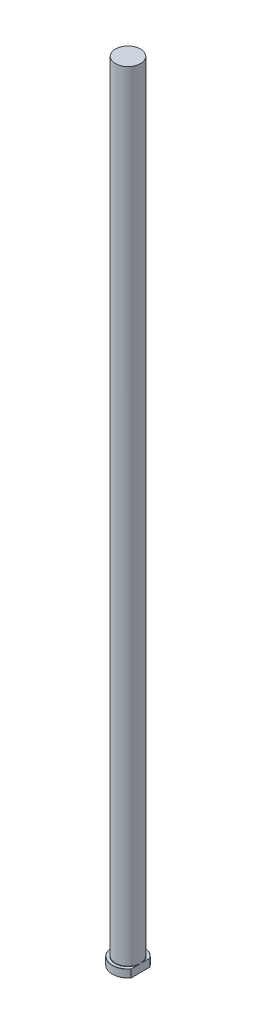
ISO-10303-21;
HEADER;
FILE_DESCRIPTION(('STEP AP214'),'2;1');
FILE_NAME('part.step','',(''),(''),'','','');
FILE_SCHEMA(('AUTOMOTIVE_DESIGN { 1 0 10303 214 1 1 1 1 }'));
ENDSEC;
DATA;
#1=APPLICATION_CONTEXT('core data for automotive mechanical design processes');
#2=APPLICATION_PROTOCOL_DEFINITION('international standard','automotive_design',2000,#1);
#3=PRODUCT_CONTEXT('',#1,'mechanical');
#4=PRODUCT('Part','Part','',(#3));
#5=PRODUCT_RELATED_PRODUCT_CATEGORY('part','',(#4));
#6=PRODUCT_DEFINITION_FORMATION('','',#4);
#7=PRODUCT_DEFINITION_CONTEXT('part definition',#1,'design');
#8=PRODUCT_DEFINITION('design','',#6,#7);
#9=PRODUCT_DEFINITION_SHAPE('','',#8);
#10=(LENGTH_UNIT() NAMED_UNIT(*) SI_UNIT(.MILLI.,.METRE.));
#11=(NAMED_UNIT(*) PLANE_ANGLE_UNIT() SI_UNIT($,.RADIAN.));
#12=(NAMED_UNIT(*) SI_UNIT($,.STERADIAN.) SOLID_ANGLE_UNIT());
#13=UNCERTAINTY_MEASURE_WITH_UNIT(LENGTH_MEASURE(1.E-05),#10,'distance_accuracy_value','');
#14=(GEOMETRIC_REPRESENTATION_CONTEXT(3) GLOBAL_UNCERTAINTY_ASSIGNED_CONTEXT((#13)) GLOBAL_UNIT_ASSIGNED_CONTEXT((#10,
#11,#12)) REPRESENTATION_CONTEXT('',''));
#15=CARTESIAN_POINT('',(0.,0.,0.));
#16=DIRECTION('',(0.,0.,1.));
#17=DIRECTION('',(1.,0.,0.));
#18=AXIS2_PLACEMENT_3D('',#15,#16,#17);
#19=CARTESIAN_POINT('',(0.,0.,0.));
#20=DIRECTION('',(0.,-1.,0.));
#21=DIRECTION('',(0.,0.,-1.));
#22=AXIS2_PLACEMENT_3D('',#19,#20,#21);
#23=PLANE('',#22);
#24=CARTESIAN_POINT('',(0.,0.,0.));
#25=DIRECTION('',(0.,-1.,0.));
#26=DIRECTION('',(0.,0.,-1.));
#27=AXIS2_PLACEMENT_3D('',#24,#25,#26);
#28=CIRCLE('',#27,19.7999999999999);
#29=CARTESIAN_POINT('',(16.,0.,11.6636186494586));
#30=VERTEX_POINT('',#29);
#31=CARTESIAN_POINT('',(16.,0.,-11.6636186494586));
#32=VERTEX_POINT('',#31);
#33=EDGE_CURVE('E98',#30,#32,#28,.T.);
#34=ORIENTED_EDGE('',*,*,#33,.T.);
#35=DIRECTION('',(0.,0.,1.));
#36=VECTOR('',#35,1.);
#37=CARTESIAN_POINT('',(16.,0.,-12.));
#38=LINE('',#37,#36);
#39=EDGE_CURVE('E83',#32,#30,#38,.T.);
#40=ORIENTED_EDGE('',*,*,#39,.T.);
#41=EDGE_LOOP('',(#34,#40));
#42=FACE_BOUND('',#41,.T.);
#43=ADVANCED_FACE('F32',(#42),#23,.T.);
#44=CARTESIAN_POINT('',(0.,259.958771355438,0.));
#45=DIRECTION('',(0.,1.,0.));
#46=DIRECTION('',(0.,0.,1.));
#47=AXIS2_PLACEMENT_3D('',#44,#45,#46);
#48=CYLINDRICAL_SURFACE('',#47,20.);
#49=CARTESIAN_POINT('',(0.,9.80000000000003,0.));
#50=DIRECTION('',(0.,1.,0.));
#51=DIRECTION('',(0.,0.,1.));
#52=AXIS2_PLACEMENT_3D('',#49,#50,#51);
#53=CIRCLE('',#52,20.);
#54=CARTESIAN_POINT('',(16.,9.80000000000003,12.));
#55=VERTEX_POINT('',#54);
#56=CARTESIAN_POINT('',(16.,9.80000000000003,-12.));
#57=VERTEX_POINT('',#56);
#58=EDGE_CURVE('E104',#55,#57,#53,.F.);
#59=ORIENTED_EDGE('',*,*,#58,.T.);
#60=DIRECTION('',(0.,-1.,0.));
#61=VECTOR('',#60,1.);
#62=CARTESIAN_POINT('',(16.,1000.,-12.));
#63=LINE('',#62,#61);
#64=CARTESIAN_POINT('',(16.,0.200000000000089,-12.));
#65=VERTEX_POINT('',#64);
#66=EDGE_CURVE('E183',#57,#65,#63,.T.);
#67=ORIENTED_EDGE('',*,*,#66,.T.);
#68=CARTESIAN_POINT('',(0.,0.200000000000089,0.));
#69=DIRECTION('',(0.,-1.,0.));
#70=DIRECTION('',(0.,0.,-1.));
#71=AXIS2_PLACEMENT_3D('',#68,#69,#70);
#72=CIRCLE('',#71,20.);
#73=CARTESIAN_POINT('',(16.,0.200000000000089,12.));
#74=VERTEX_POINT('',#73);
#75=EDGE_CURVE('E100',#65,#74,#72,.F.);
#76=ORIENTED_EDGE('',*,*,#75,.T.);
#77=DIRECTION('',(0.,-1.,0.));
#78=VECTOR('',#77,1.);
#79=CARTESIAN_POINT('',(16.,1000.,12.));
#80=LINE('',#79,#78);
#81=EDGE_CURVE('E93',#55,#74,#80,.T.);
#82=ORIENTED_EDGE('',*,*,#81,.F.);
#83=EDGE_LOOP('',(#59,#67,#76,#82));
#84=FACE_BOUND('',#83,.T.);
#85=ADVANCED_FACE('F158',(#84),#48,.T.);
#86=CARTESIAN_POINT('',(-20.,10.,0.));
#87=DIRECTION('',(0.,1.,0.));
#88=DIRECTION('',(0.,0.,1.));
#89=AXIS2_PLACEMENT_3D('',#86,#87,#88);
#90=PLANE('',#89);
#91=CARTESIAN_POINT('',(0.,10.,0.));
#92=DIRECTION('',(0.,1.,0.));
#93=DIRECTION('',(0.,0.,1.));
#94=AXIS2_PLACEMENT_3D('',#91,#92,#93);
#95=CIRCLE('',#94,19.7999999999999);
#96=CARTESIAN_POINT('',(16.,10.,-11.6636186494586));
#97=VERTEX_POINT('',#96);
#98=CARTESIAN_POINT('',(16.,10.,11.6636186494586));
#99=VERTEX_POINT('',#98);
#100=EDGE_CURVE('E178',#97,#99,#95,.T.);
#101=ORIENTED_EDGE('',*,*,#100,.T.);
#102=DIRECTION('',(0.,0.,-1.));
#103=VECTOR('',#102,1.);
#104=CARTESIAN_POINT('',(16.,10.,0.));
#105=LINE('',#104,#103);
#106=CARTESIAN_POINT('',(16.,10.,3.1128764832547));
#107=VERTEX_POINT('',#106);
#108=EDGE_CURVE('E57',#99,#107,#105,.T.);
#109=ORIENTED_EDGE('',*,*,#108,.T.);
#110=CARTESIAN_POINT('',(0.,10.,0.));
#111=DIRECTION('',(0.,1.,0.));
#112=DIRECTION('',(0.,0.,1.));
#113=AXIS2_PLACEMENT_3D('',#110,#111,#112);
#114=CIRCLE('',#113,16.3);
#115=CARTESIAN_POINT('',(16.,10.,-3.11287648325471));
#116=VERTEX_POINT('',#115);
#117=EDGE_CURVE('E107',#107,#116,#114,.F.);
#118=ORIENTED_EDGE('',*,*,#117,.T.);
#119=EDGE_CURVE('E136',#116,#97,#105,.T.);
#120=ORIENTED_EDGE('',*,*,#119,.T.);
#121=EDGE_LOOP('',(#101,#109,#118,#120));
#122=FACE_BOUND('',#121,.T.);
#123=ADVANCED_FACE('F147',(#122),#90,.T.);
#124=CARTESIAN_POINT('',(0.,10.,0.));
#125=DIRECTION('',(0.,-1.,0.));
#126=DIRECTION('',(0.,0.,-1.));
#127=AXIS2_PLACEMENT_3D('',#124,#125,#126);
#128=CONICAL_SURFACE('',#127,19.7999999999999,0.785398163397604);
#129=ORIENTED_EDGE('',*,*,#58,.F.);
#130=CARTESIAN_POINT('',(16.,-1.07064884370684,26.4006999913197));
#131=CARTESIAN_POINT('',(16.,-0.733156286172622,26.0060486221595));
#132=CARTESIAN_POINT('',(16.,-0.396819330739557,25.6104050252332));
#133=CARTESIAN_POINT('',(16.,0.27320617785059,24.8168690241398));
#134=CARTESIAN_POINT('',(16.,0.606894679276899,24.4189765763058));
#135=CARTESIAN_POINT('',(16.,1.27144329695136,23.6204891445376));
#136=CARTESIAN_POINT('',(16.,1.60230187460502,23.2198928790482));
#137=CARTESIAN_POINT('',(16.,2.26059114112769,22.4158945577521));
#138=CARTESIAN_POINT('',(16.,2.58802184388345,22.0124925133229));
#139=CARTESIAN_POINT('',(16.,3.24766747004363,21.1916872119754));
#140=CARTESIAN_POINT('',(16.,3.57977582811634,20.7741982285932));
#141=CARTESIAN_POINT('',(16.,4.23919239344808,19.9354474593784));
#142=CARTESIAN_POINT('',(16.,4.566500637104,19.5141857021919));
#143=CARTESIAN_POINT('',(16.,5.21544461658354,18.6674666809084));
#144=CARTESIAN_POINT('',(16.,5.53708166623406,18.2420104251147));
#145=CARTESIAN_POINT('',(16.,6.17378218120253,17.386199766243));
#146=CARTESIAN_POINT('',(16.,6.48884565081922,16.9558453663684));
#147=CARTESIAN_POINT('',(16.,7.11176935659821,16.08872181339));
#148=CARTESIAN_POINT('',(16.,7.41961501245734,15.651942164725));
#149=CARTESIAN_POINT('',(16.,8.02597466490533,14.7719292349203));
#150=CARTESIAN_POINT('',(16.,8.32448855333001,14.3286958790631));
#151=CARTESIAN_POINT('',(16.,8.91052998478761,13.4344389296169));
#152=CARTESIAN_POINT('',(16.,9.19804754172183,12.983408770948));
#153=CARTESIAN_POINT('',(16.,9.75938980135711,12.0728858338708));
#154=CARTESIAN_POINT('',(16.,10.0332147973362,11.6133932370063));
#155=CARTESIAN_POINT('',(16.,10.561533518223,10.6892898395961));
#156=CARTESIAN_POINT('',(16.,10.8161891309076,10.2247720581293));
#157=CARTESIAN_POINT('',(16.,11.3053445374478,9.28510847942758));
#158=CARTESIAN_POINT('',(16.,11.539841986,8.809961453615));
#159=CARTESIAN_POINT('',(16.,11.9836278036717,7.84885100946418));
#160=CARTESIAN_POINT('',(16.,12.1929556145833,7.36290596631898));
#161=CARTESIAN_POINT('',(16.,12.5811435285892,6.37912337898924));
#162=CARTESIAN_POINT('',(16.,12.7600157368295,5.88129064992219));
#163=CARTESIAN_POINT('',(16.,13.0861366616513,4.85753764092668));
#164=CARTESIAN_POINT('',(16.,13.2321910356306,4.3312282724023));
#165=CARTESIAN_POINT('',(16.,13.4164504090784,3.53379728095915));
#166=CARTESIAN_POINT('',(16.,13.4720698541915,3.26663533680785));
#167=CARTESIAN_POINT('',(16.,13.5709016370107,2.73003918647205));
#168=CARTESIAN_POINT('',(16.,13.6141156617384,2.460605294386));
#169=CARTESIAN_POINT('',(16.,13.6872774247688,1.92117630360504));
#170=CARTESIAN_POINT('',(16.,13.7172841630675,1.65118922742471));
#171=CARTESIAN_POINT('',(16.,13.7638048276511,1.11005042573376));
#172=CARTESIAN_POINT('',(16.,13.7803188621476,0.83889870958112));
#173=CARTESIAN_POINT('',(16.,13.7995586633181,0.296109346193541));
#174=CARTESIAN_POINT('',(16.,13.8022847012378,0.0244717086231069));
#175=CARTESIAN_POINT('',(16.,13.7939006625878,-0.518588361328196));
#176=CARTESIAN_POINT('',(16.,13.7827905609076,-0.790010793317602));
#177=CARTESIAN_POINT('',(16.,13.7469663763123,-1.33142514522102));
#178=CARTESIAN_POINT('',(16.,13.7222788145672,-1.60141882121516));
#179=CARTESIAN_POINT('',(16.,13.6597540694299,-2.13989179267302));
#180=CARTESIAN_POINT('',(16.,13.6219151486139,-2.40837088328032));
#181=CARTESIAN_POINT('',(16.,13.4895557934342,-3.21066813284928));
#182=CARTESIAN_POINT('',(16.,13.3761851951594,-3.74145456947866));
#183=CARTESIAN_POINT('',(16.,13.1048507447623,-4.79469191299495));
#184=CARTESIAN_POINT('',(16.,12.9466209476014,-5.31707285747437));
#185=CARTESIAN_POINT('',(16.,12.6815624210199,-6.09095035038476));
#186=CARTESIAN_POINT('',(16.,12.5885858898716,-6.34730496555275));
#187=CARTESIAN_POINT('',(16.,12.3942381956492,-6.85681818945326));
#188=CARTESIAN_POINT('',(16.,12.2928668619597,-7.10997673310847));
#189=CARTESIAN_POINT('',(16.,11.9087737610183,-8.02895093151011));
#190=CARTESIAN_POINT('',(16.,11.6032209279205,-8.68528507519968));
#191=CARTESIAN_POINT('',(16.,10.9520387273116,-9.97785473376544));
#192=CARTESIAN_POINT('',(16.,10.606384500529,-10.6140774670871));
#193=CARTESIAN_POINT('',(16.,9.88410853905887,-11.8704402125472));
#194=CARTESIAN_POINT('',(16.,9.50742027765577,-12.490541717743));
#195=CARTESIAN_POINT('',(16.,8.73104614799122,-13.7158784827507));
#196=CARTESIAN_POINT('',(16.,8.33136526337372,-14.3211169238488));
#197=CARTESIAN_POINT('',(16.,7.51225576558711,-15.522152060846));
#198=CARTESIAN_POINT('',(16.,7.09274396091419,-16.1178917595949));
#199=CARTESIAN_POINT('',(16.,6.23957009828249,-17.2991512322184));
#200=CARTESIAN_POINT('',(16.,5.80590743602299,-17.8846705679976));
#201=CARTESIAN_POINT('',(16.,4.92783508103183,-19.0464967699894));
#202=CARTESIAN_POINT('',(16.,4.48343853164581,-19.622813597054));
#203=CARTESIAN_POINT('',(16.,3.58557777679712,-20.7683027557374));
#204=CARTESIAN_POINT('',(16.,3.13211380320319,-21.3374752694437));
#205=CARTESIAN_POINT('',(16.,2.36744022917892,-22.2844266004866));
#206=CARTESIAN_POINT('',(16.,2.05826684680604,-22.66385398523));
#207=CARTESIAN_POINT('',(16.,1.43690833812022,-23.4203229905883));
#208=CARTESIAN_POINT('',(16.,1.12472279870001,-23.7973642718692));
#209=CARTESIAN_POINT('',(16.,0.49995656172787,-24.5465888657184));
#210=CARTESIAN_POINT('',(16.,0.18739441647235,-24.9187876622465));
#211=CARTESIAN_POINT('',(16.,-0.439990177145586,-25.6611808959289));
#212=CARTESIAN_POINT('',(16.,-0.754812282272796,-26.0313756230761));
#213=CARTESIAN_POINT('',(16.,-1.07064884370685,-26.4006999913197));
#214=B_SPLINE_CURVE_WITH_KNOTS('',3,(#130,#131,#132,#133,#134,#135,#136,#137,#138,#139,#140,
#141,#142,#143,#144,#145,#146,#147,#148,#149,#150,#151,#152,#153,#154,#155,#156,#157,#158,#159,
#160,#161,#162,#163,#164,#165,#166,#167,#168,#169,#170,#171,#172,#173,#174,#175,#176,#177,#178,
#179,#180,#181,#182,#183,#184,#185,#186,#187,#188,#189,#190,#191,#192,#193,#194,#195,#196,#197,
#198,#199,#200,#201,#202,#203,#204,#205,#206,#207,#208,#209,#210,#211,#212,#213),.UNSPECIFIED.,
.F.,.F.,(4,2,2,2,2,2,2,2,2,2,2,2,2,2,2,2,2,2,2,2,2,2,2,2,2,2,2,2,2,2,2,2,2,2,2,2,2,2,2,2,2,4),
(0.,1.55783999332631,3.11571034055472,4.67437978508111,6.23304291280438,7.83343038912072,
9.43380572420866,11.0338053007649,12.6338038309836,14.236795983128,15.8398067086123,
17.4442401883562,19.048639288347,20.6374598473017,22.226465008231,23.8129467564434,
25.3987964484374,27.0353648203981,27.8537926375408,28.6721091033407,29.4867319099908,
30.3013481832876,31.1159484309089,31.9305501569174,32.7435663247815,33.5566899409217,
35.1826128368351,36.8183840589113,37.6363419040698,38.4543163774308,40.6241539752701,
42.7953439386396,44.9713157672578,47.1468177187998,49.3324366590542,51.5181490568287,
53.7013086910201,55.8844125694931,57.3527237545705,58.82123925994,60.2793254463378,
61.7371946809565),.UNSPECIFIED.);
#215=EDGE_CURVE('E135',#55,#99,#214,.T.);
#216=ORIENTED_EDGE('',*,*,#215,.T.);
#217=ORIENTED_EDGE('',*,*,#100,.F.);
#218=EDGE_CURVE('E127',#97,#57,#214,.T.);
#219=ORIENTED_EDGE('',*,*,#218,.T.);
#220=EDGE_LOOP('',(#129,#216,#217,#219));
#221=FACE_BOUND('',#220,.T.);
#222=ADVANCED_FACE('F143',(#221),#128,.T.);
#223=CARTESIAN_POINT('',(0.,0.200000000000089,0.));
#224=DIRECTION('',(0.,1.,0.));
#225=DIRECTION('',(0.,0.,1.));
#226=AXIS2_PLACEMENT_3D('',#223,#224,#225);
#227=CONICAL_SURFACE('',#226,20.,0.785398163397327);
#228=ORIENTED_EDGE('',*,*,#75,.F.);
#229=CARTESIAN_POINT('',(16.,11.070648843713,-26.4006999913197));
#230=CARTESIAN_POINT('',(16.,10.7331562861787,-26.0060486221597));
#231=CARTESIAN_POINT('',(16.,10.3968193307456,-25.6104050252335));
#232=CARTESIAN_POINT('',(16.,9.72679382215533,-24.8168690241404));
#233=CARTESIAN_POINT('',(16.,9.39310532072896,-24.4189765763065));
#234=CARTESIAN_POINT('',(16.,8.72855670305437,-23.6204891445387));
#235=CARTESIAN_POINT('',(16.,8.39769812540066,-23.2198928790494));
#236=CARTESIAN_POINT('',(16.,7.73940885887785,-22.4158945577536));
#237=CARTESIAN_POINT('',(16.,7.41197815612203,-22.0124925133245));
#238=CARTESIAN_POINT('',(16.,6.75233252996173,-21.1916872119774));
#239=CARTESIAN_POINT('',(16.,6.42022417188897,-20.7741982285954));
#240=CARTESIAN_POINT('',(16.,5.76080760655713,-19.935447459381));
#241=CARTESIAN_POINT('',(16.,5.43349936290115,-19.5141857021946));
#242=CARTESIAN_POINT('',(16.,4.7845553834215,-18.6674666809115));
#243=CARTESIAN_POINT('',(16.,4.46291833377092,-18.242010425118));
#244=CARTESIAN_POINT('',(16.,3.82621781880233,-17.3861997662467));
#245=CARTESIAN_POINT('',(16.,3.51115434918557,-16.9558453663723));
#246=CARTESIAN_POINT('',(16.,2.88823064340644,-16.0887218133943));
#247=CARTESIAN_POINT('',(16.,2.58038498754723,-15.6519421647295));
#248=CARTESIAN_POINT('',(16.,1.97402533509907,-14.7719292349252));
#249=CARTESIAN_POINT('',(16.,1.67551144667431,-14.3286958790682));
#250=CARTESIAN_POINT('',(16.,1.08947001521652,-13.4344389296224));
#251=CARTESIAN_POINT('',(16.,0.801952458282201,-12.9834087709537));
#252=CARTESIAN_POINT('',(16.,0.240610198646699,-12.0728858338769));
#253=CARTESIAN_POINT('',(16.,-0.0332147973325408,-11.6133932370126));
#254=CARTESIAN_POINT('',(16.,-0.561533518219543,-10.6892898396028));
#255=CARTESIAN_POINT('',(16.,-0.816189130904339,-10.2247720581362));
#256=CARTESIAN_POINT('',(16.,-1.30534453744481,-9.28510847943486));
#257=CARTESIAN_POINT('',(16.,-1.53984198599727,-8.80996145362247));
#258=CARTESIAN_POINT('',(16.,-1.98362780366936,-7.84885100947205));
#259=CARTESIAN_POINT('',(16.,-2.19295561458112,-7.36290596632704));
#260=CARTESIAN_POINT('',(16.,-2.58114352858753,-6.37912337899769));
#261=CARTESIAN_POINT('',(16.,-2.76001573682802,-5.88129064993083));
#262=CARTESIAN_POINT('',(16.,-3.08613666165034,-4.85753764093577));
#263=CARTESIAN_POINT('',(16.,-3.2321910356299,-4.33122827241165));
#264=CARTESIAN_POINT('',(16.,-3.41645040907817,-3.53379728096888));
#265=CARTESIAN_POINT('',(16.,-3.47206985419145,-3.2666353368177));
#266=CARTESIAN_POINT('',(16.,-3.57090163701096,-2.73003918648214));
#267=CARTESIAN_POINT('',(16.,-3.61411566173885,-2.46060529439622));
#268=CARTESIAN_POINT('',(16.,-3.68727742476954,-1.92117630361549));
#269=CARTESIAN_POINT('',(16.,-3.71728416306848,-1.65118922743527));
#270=CARTESIAN_POINT('',(16.,-3.76380482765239,-1.11005042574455));
#271=CARTESIAN_POINT('',(16.,-3.78031886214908,-0.838898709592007));
#272=CARTESIAN_POINT('',(16.,-3.79955866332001,-0.296109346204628));
#273=CARTESIAN_POINT('',(16.,-3.80228470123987,-0.024471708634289));
#274=CARTESIAN_POINT('',(16.,-3.79390066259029,0.518588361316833));
#275=CARTESIAN_POINT('',(16.,-3.78279056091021,0.790010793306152));
#276=CARTESIAN_POINT('',(16.,-3.74696637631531,1.33142514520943));
#277=CARTESIAN_POINT('',(16.,-3.72227881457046,1.6014188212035));
#278=CARTESIAN_POINT('',(16.,-3.65975406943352,2.13989179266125));
#279=CARTESIAN_POINT('',(16.,-3.62191514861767,2.4083708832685));
#280=CARTESIAN_POINT('',(16.,-3.48955579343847,3.21066813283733));
#281=CARTESIAN_POINT('',(16.,-3.37618519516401,3.74145456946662));
#282=CARTESIAN_POINT('',(16.,-3.10485074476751,4.79469191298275));
#283=CARTESIAN_POINT('',(16.,-2.94662094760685,5.3170728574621));
#284=CARTESIAN_POINT('',(16.,-2.68156242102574,6.09095035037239));
#285=CARTESIAN_POINT('',(16.,-2.58858588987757,6.34730496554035));
#286=CARTESIAN_POINT('',(16.,-2.39423819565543,6.85681818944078));
#287=CARTESIAN_POINT('',(16.,-2.29286686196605,7.10997673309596));
#288=CARTESIAN_POINT('',(16.,-1.9087737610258,8.0289509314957));
#289=CARTESIAN_POINT('',(16.,-1.60322092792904,8.68528507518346));
#290=CARTESIAN_POINT('',(16.,-0.952038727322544,9.97785473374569));
#291=CARTESIAN_POINT('',(16.,-0.606384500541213,10.6140774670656));
#292=CARTESIAN_POINT('',(16.,0.115891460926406,11.8704402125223));
#293=CARTESIAN_POINT('',(16.,0.492579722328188,12.4905417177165));
#294=CARTESIAN_POINT('',(16.,1.26895385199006,13.7158784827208));
#295=CARTESIAN_POINT('',(16.,1.6686347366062,14.3211169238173));
#296=CARTESIAN_POINT('',(16.,2.48774423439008,15.5221520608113));
#297=CARTESIAN_POINT('',(16.,2.90725603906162,16.1178917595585));
#298=CARTESIAN_POINT('',(16.,3.76042990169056,17.2991512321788));
#299=CARTESIAN_POINT('',(16.,4.19409256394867,17.8846705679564));
#300=CARTESIAN_POINT('',(16.,5.07216491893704,19.0464967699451));
#301=CARTESIAN_POINT('',(16.,5.51656146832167,19.6228135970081));
#302=CARTESIAN_POINT('',(16.,6.41442222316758,20.7683027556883));
#303=CARTESIAN_POINT('',(16.,6.8678861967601,21.337475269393));
#304=CARTESIAN_POINT('',(16.,7.63255977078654,22.2844266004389));
#305=CARTESIAN_POINT('',(16.,7.94173315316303,22.6638539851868));
#306=CARTESIAN_POINT('',(16.,8.56309166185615,23.420322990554));
#307=CARTESIAN_POINT('',(16.,8.87527720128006,23.7973642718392));
#308=CARTESIAN_POINT('',(16.,9.50004343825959,24.5465888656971));
#309=CARTESIAN_POINT('',(16.,9.81260558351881,24.9187876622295));
#310=CARTESIAN_POINT('',(16.,10.4399901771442,25.6611808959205));
#311=CARTESIAN_POINT('',(16.,10.7548122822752,26.0313756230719));
#312=CARTESIAN_POINT('',(16.,11.070648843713,26.4006999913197));
#313=B_SPLINE_CURVE_WITH_KNOTS('',3,(#229,#230,#231,#232,#233,#234,#235,#236,#237,#238,#239,
#240,#241,#242,#243,#244,#245,#246,#247,#248,#249,#250,#251,#252,#253,#254,#255,#256,#257,#258,
#259,#260,#261,#262,#263,#264,#265,#266,#267,#268,#269,#270,#271,#272,#273,#274,#275,#276,#277,
#278,#279,#280,#281,#282,#283,#284,#285,#286,#287,#288,#289,#290,#291,#292,#293,#294,#295,#296,
#297,#298,#299,#300,#301,#302,#303,#304,#305,#306,#307,#308,#309,#310,#311,#312),.UNSPECIFIED.,
.F.,.F.,(4,2,2,2,2,2,2,2,2,2,2,2,2,2,2,2,2,2,2,2,2,2,2,2,2,2,2,2,2,2,2,2,2,2,2,2,2,2,2,2,2,4),
(0.,1.55783999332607,3.11571034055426,4.67437978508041,6.23304291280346,7.83343038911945,
9.43380572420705,11.0338053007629,12.6338038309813,14.2367959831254,15.8398067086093,
17.4442401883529,19.0486392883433,20.6374598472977,22.2264650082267,23.8129467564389,
25.3987964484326,27.0353648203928,27.8537926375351,28.6721091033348,29.4867319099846,
30.3013481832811,31.1159484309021,31.9305501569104,32.7435663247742,33.5566899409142,
35.1826128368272,36.8183840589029,37.6363419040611,38.4543163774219,40.6241539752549,
42.7953439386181,44.97131576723,47.1468177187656,49.3324366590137,51.5181490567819,
53.7013086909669,55.8844125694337,57.3527237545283,58.821239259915,60.2793254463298,
61.7371946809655),.UNSPECIFIED.);
#314=EDGE_CURVE('E86',#65,#32,#313,.T.);
#315=ORIENTED_EDGE('',*,*,#314,.T.);
#316=ORIENTED_EDGE('',*,*,#33,.F.);
#317=EDGE_CURVE('E89',#30,#74,#313,.T.);
#318=ORIENTED_EDGE('',*,*,#317,.T.);
#319=EDGE_LOOP('',(#228,#315,#316,#318));
#320=FACE_BOUND('',#319,.T.);
#321=ADVANCED_FACE('F97',(#320),#227,.T.);
#322=CARTESIAN_POINT('',(0.,10.3,0.));
#323=DIRECTION('',(0.,1.,0.));
#324=DIRECTION('',(0.,0.,1.));
#325=AXIS2_PLACEMENT_3D('',#322,#323,#324);
#326=TOROIDAL_SURFACE('',#325,16.3,0.3);
#327=CARTESIAN_POINT('',(16.,10.3,0.));
#328=CARTESIAN_POINT('',(16.,10.3000006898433,-5.33715911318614E-09));
#329=CARTESIAN_POINT('',(16.,10.3000013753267,-5.90477996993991E-07));
#330=CARTESIAN_POINT('',(16.,10.3000026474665,-1.99315110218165E-06));
#331=CARTESIAN_POINT('',(16.,10.3000031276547,-2.82387138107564E-06));
#332=CARTESIAN_POINT('',(16.,10.300004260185,-4.93201352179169E-06));
#333=CARTESIAN_POINT('',(16.,10.300004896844,-6.24688723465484E-06));
#334=CARTESIAN_POINT('',(16.,10.3000059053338,-8.79561581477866E-06));
#335=CARTESIAN_POINT('',(16.,10.3000062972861,-1.00244169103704E-05));
#336=CARTESIAN_POINT('',(16.,10.3000079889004,-1.53269558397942E-05));
#337=CARTESIAN_POINT('',(16.,10.3000092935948,-1.94146126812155E-05));
#338=CARTESIAN_POINT('',(16.,10.3000111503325,-2.70530674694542E-05));
#339=CARTESIAN_POINT('',(16.,10.300011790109,-3.05834546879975E-05));
#340=CARTESIAN_POINT('',(16.,10.3000164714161,-5.69924666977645E-05));
#341=CARTESIAN_POINT('',(16.,10.3000199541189,-7.99464318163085E-05));
#342=CARTESIAN_POINT('',(16.,10.3000322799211,-0.000171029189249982));
#343=CARTESIAN_POINT('',(16.,10.3000382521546,-0.000239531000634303));
#344=CARTESIAN_POINT('',(16.,10.3000656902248,-0.00050618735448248));
#345=CARTESIAN_POINT('',(16.,10.3000950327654,-0.0007033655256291));
#346=CARTESIAN_POINT('',(16.,10.3002038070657,-0.0014556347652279));
#347=CARTESIAN_POINT('',(16.,10.300277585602,-0.00201139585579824));
#348=CARTESIAN_POINT('',(16.,10.3005644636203,-0.00414914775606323));
#349=CARTESIAN_POINT('',(16.,10.300783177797,-0.00573048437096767));
#350=CARTESIAN_POINT('',(16.,10.3018172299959,-0.0132287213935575));
#351=CARTESIAN_POINT('',(16.,10.3026243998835,-0.0191465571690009));
#352=CARTESIAN_POINT('',(16.,10.3110865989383,-0.0811528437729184));
#353=CARTESIAN_POINT('',(16.,10.3187815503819,-0.137236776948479));
#354=CARTESIAN_POINT('',(16.,10.3348868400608,-0.255096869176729));
#355=CARTESIAN_POINT('',(16.,10.343290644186,-0.316873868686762));
#356=CARTESIAN_POINT('',(16.,10.3571569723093,-0.419331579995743));
#357=CARTESIAN_POINT('',(16.,10.3626434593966,-0.460008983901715));
#358=CARTESIAN_POINT('',(16.,10.3734224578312,-0.540334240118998));
#359=CARTESIAN_POINT('',(16.,10.3787163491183,-0.579981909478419));
#360=CARTESIAN_POINT('',(16.,10.4083966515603,-0.803619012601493));
#361=CARTESIAN_POINT('',(16.,10.4321379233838,-0.987696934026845));
#362=CARTESIAN_POINT('',(16.,10.4771585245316,-1.35808125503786));
#363=CARTESIAN_POINT('',(16.,10.4984099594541,-1.54439106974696));
#364=CARTESIAN_POINT('',(16.,10.5392977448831,-1.94430528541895));
#365=CARTESIAN_POINT('',(16.,10.5582626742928,-2.15798298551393));
#366=CARTESIAN_POINT('',(16.,10.5798230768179,-2.47853128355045));
#367=CARTESIAN_POINT('',(16.,10.5858566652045,-2.58516682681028));
#368=CARTESIAN_POINT('',(16.,10.5950189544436,-2.79855398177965));
#369=CARTESIAN_POINT('',(16.,10.5981480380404,-2.90530557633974));
#370=CARTESIAN_POINT('',(16.,10.6006064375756,-3.11480969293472));
#371=CARTESIAN_POINT('',(16.,10.600075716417,-3.21755992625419));
#372=CARTESIAN_POINT('',(16.,10.5957602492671,-3.37181907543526));
#373=CARTESIAN_POINT('',(16.,10.593726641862,-3.42337702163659));
#374=CARTESIAN_POINT('',(16.,10.5882429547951,-3.52640582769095));
#375=CARTESIAN_POINT('',(16.,10.584793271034,-3.57787670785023));
#376=CARTESIAN_POINT('',(16.,10.5763123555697,-3.67890194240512));
#377=CARTESIAN_POINT('',(16.,10.5713398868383,-3.72846106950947));
#378=CARTESIAN_POINT('',(16.,10.5593485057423,-3.82738811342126));
#379=CARTESIAN_POINT('',(16.,10.5523274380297,-3.87675577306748));
#380=CARTESIAN_POINT('',(16.,10.5356271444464,-3.97473922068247));
#381=CARTESIAN_POINT('',(16.,10.5259654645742,-4.02335780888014));
#382=CARTESIAN_POINT('',(16.,10.5085240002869,-4.09553189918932));
#383=CARTESIAN_POINT('',(16.,10.5022253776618,-4.11944402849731));
#384=CARTESIAN_POINT('',(16.,10.4883597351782,-4.16689390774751));
#385=CARTESIAN_POINT('',(16.,10.4807934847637,-4.19043187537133));
#386=CARTESIAN_POINT('',(16.,10.468072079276,-4.22548932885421));
#387=CARTESIAN_POINT('',(16.,10.463554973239,-4.23724015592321));
#388=CARTESIAN_POINT('',(16.,10.4539723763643,-4.2605292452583));
#389=CARTESIAN_POINT('',(16.,10.4489064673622,-4.27206733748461));
#390=CARTESIAN_POINT('',(16.,10.4380905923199,-4.29485009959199));
#391=CARTESIAN_POINT('',(16.,10.4323392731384,-4.30609413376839));
#392=CARTESIAN_POINT('',(16.,10.4199753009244,-4.32809262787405));
#393=CARTESIAN_POINT('',(16.,10.4133636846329,-4.33884765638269));
#394=CARTESIAN_POINT('',(16.,10.3989169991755,-4.35969720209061));
#395=CARTESIAN_POINT('',(16.,10.3910687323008,-4.36978269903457));
#396=CARTESIAN_POINT('',(16.,10.3737930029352,-4.38847604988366));
#397=CARTESIAN_POINT('',(16.,10.3643793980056,-4.39709563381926));
#398=CARTESIAN_POINT('',(16.,10.349684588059,-4.40721260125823));
#399=CARTESIAN_POINT('',(16.,10.3452411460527,-4.40991204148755));
#400=CARTESIAN_POINT('',(16.,10.3360120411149,-4.41465735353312));
#401=CARTESIAN_POINT('',(16.,10.331226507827,-4.41670347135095));
#402=CARTESIAN_POINT('',(16.,10.321316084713,-4.41997867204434));
#403=CARTESIAN_POINT('',(16.,10.3161880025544,-4.42119837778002));
#404=CARTESIAN_POINT('',(16.,10.3057936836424,-4.42262740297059));
#405=CARTESIAN_POINT('',(16.,10.3005276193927,-4.42283792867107));
#406=CARTESIAN_POINT('',(16.,10.2906214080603,-4.42225569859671));
#407=CARTESIAN_POINT('',(16.,10.285974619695,-4.42156796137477));
#408=CARTESIAN_POINT('',(16.,10.2768560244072,-4.41944337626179));
#409=CARTESIAN_POINT('',(16.,10.2723843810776,-4.41800584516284));
#410=CARTESIAN_POINT('',(16.,10.2619701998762,-4.41381248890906));
#411=CARTESIAN_POINT('',(16.,10.2561483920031,-4.4107598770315));
#412=CARTESIAN_POINT('',(16.,10.2450526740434,-4.40378684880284));
#413=CARTESIAN_POINT('',(16.,10.239780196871,-4.39986424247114));
#414=CARTESIAN_POINT('',(16.,10.2257729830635,-4.38808908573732));
#415=CARTESIAN_POINT('',(16.,10.2175965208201,-4.37958133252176));
#416=CARTESIAN_POINT('',(16.,10.2024790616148,-4.36154434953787));
#417=CARTESIAN_POINT('',(16.,10.1955419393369,-4.35201206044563));
#418=CARTESIAN_POINT('',(16.,10.1791886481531,-4.32717029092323));
#419=CARTESIAN_POINT('',(16.,10.1703884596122,-4.31145991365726));
#420=CARTESIAN_POINT('',(16.,10.154248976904,-4.2792945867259));
#421=CARTESIAN_POINT('',(16.,10.1469131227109,-4.26283799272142));
#422=CARTESIAN_POINT('',(16.,10.1332947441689,-4.22939871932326));
#423=CARTESIAN_POINT('',(16.,10.1270179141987,-4.2124137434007));
#424=CARTESIAN_POINT('',(16.,10.1153239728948,-4.17817736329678));
#425=CARTESIAN_POINT('',(16.,10.1099058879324,-4.16092628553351));
#426=CARTESIAN_POINT('',(16.,10.0949674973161,-4.10989946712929));
#427=CARTESIAN_POINT('',(16.,10.0863847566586,-4.07584989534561));
#428=CARTESIAN_POINT('',(16.,10.0710343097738,-4.00733871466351));
#429=CARTESIAN_POINT('',(16.,10.0642677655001,-3.97287685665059));
#430=CARTESIAN_POINT('',(16.,10.0460186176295,-3.86898411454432));
#431=CARTESIAN_POINT('',(16.,10.036623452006,-3.79918851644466));
#432=CARTESIAN_POINT('',(16.,10.0215249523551,-3.65915321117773));
#433=CARTESIAN_POINT('',(16.,10.0158261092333,-3.58891306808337));
#434=CARTESIAN_POINT('',(16.,10.0072116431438,-3.44836432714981));
#435=CARTESIAN_POINT('',(16.,10.00429218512,-3.37805595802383));
#436=CARTESIAN_POINT('',(16.,10.000668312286,-3.23904020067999));
#437=CARTESIAN_POINT('',(16.,9.99991350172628,-3.17033397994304));
#438=CARTESIAN_POINT('',(16.,10.0001018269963,-3.03292208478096));
#439=CARTESIAN_POINT('',(16.,10.0010450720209,-2.96421641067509));
#440=CARTESIAN_POINT('',(16.,10.0059904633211,-2.75810886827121));
#441=CARTESIAN_POINT('',(16.,10.0121089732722,-2.62075798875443));
#442=CARTESIAN_POINT('',(16.,10.0284391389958,-2.34612718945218));
#443=CARTESIAN_POINT('',(16.,10.0386564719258,-2.20884763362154));
#444=CARTESIAN_POINT('',(16.,10.0621466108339,-1.93454208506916));
#445=CARTESIAN_POINT('',(16.,10.075419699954,-1.79751611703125));
#446=CARTESIAN_POINT('',(16.,10.118522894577,-1.38740066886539));
#447=CARTESIAN_POINT('',(16.,10.1516806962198,-1.11466812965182));
#448=CARTESIAN_POINT('',(16.,10.2220528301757,-0.569702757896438));
#449=CARTESIAN_POINT('',(16.,10.259267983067,-0.297470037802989));
#450=CARTESIAN_POINT('',(16.,10.2965515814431,-0.0251841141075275));
#451=CARTESIAN_POINT('',(16.,10.2965597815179,-0.0251242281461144));
#452=CARTESIAN_POINT('',(16.,10.2972621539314,-0.019994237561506));
#453=CARTESIAN_POINT('',(16.,10.2979507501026,-0.0149234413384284));
#454=CARTESIAN_POINT('',(16.,10.2989595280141,-0.00761717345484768));
#455=CARTESIAN_POINT('',(16.,10.2992705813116,-0.00538056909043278));
#456=CARTESIAN_POINT('',(16.,10.2996656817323,-0.00242425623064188));
#457=CARTESIAN_POINT('',(16.,10.2997604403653,-0.00170587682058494));
#458=CARTESIAN_POINT('',(16.,10.2998960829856,-0.000765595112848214));
#459=CARTESIAN_POINT('',(16.,10.2999290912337,-0.000542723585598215));
#460=CARTESIAN_POINT('',(16.,10.2999593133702,-0.000246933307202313));
#461=CARTESIAN_POINT('',(16.,10.2999656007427,-0.000175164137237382));
#462=CARTESIAN_POINT('',(16.,10.2999790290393,-8.05668880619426E-05));
#463=CARTESIAN_POINT('',(16.,10.2999827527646,-5.72823548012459E-05));
#464=CARTESIAN_POINT('',(16.,10.2999877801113,-3.05492734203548E-05));
#465=CARTESIAN_POINT('',(16.,10.2999884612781,-2.70084595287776E-05));
#466=CARTESIAN_POINT('',(16.,10.2999904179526,-1.93523012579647E-05));
#467=CARTESIAN_POINT('',(16.,10.2999917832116,-1.52589672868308E-05));
#468=CARTESIAN_POINT('',(16.,10.2999935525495,-9.95362422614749E-06));
#469=CARTESIAN_POINT('',(16.,10.2999939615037,-8.72734435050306E-06));
#470=CARTESIAN_POINT('',(16.,10.2999950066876,-6.18658496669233E-06));
#471=CARTESIAN_POINT('',(16.,10.2999956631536,-4.87748836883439E-06));
#472=CARTESIAN_POINT('',(16.,10.2999968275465,-2.7813010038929E-06));
#473=CARTESIAN_POINT('',(16.,10.2999973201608,-1.95628425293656E-06));
#474=CARTESIAN_POINT('',(16.,10.2999986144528,-5.7037197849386E-07));
#475=CARTESIAN_POINT('',(16.,10.299999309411,5.3429283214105E-09));
#476=CARTESIAN_POINT('',(16.,10.3,0.));
#477=B_SPLINE_CURVE_WITH_KNOTS('',3,(#327,#328,#329,#330,#331,#332,#333,#334,#335,#336,#337,
#338,#339,#340,#341,#342,#343,#344,#345,#346,#347,#348,#349,#350,#351,#352,#353,#354,#355,#356,
#357,#358,#359,#360,#361,#362,#363,#364,#365,#366,#367,#368,#369,#370,#371,#372,#373,#374,#375,
#376,#377,#378,#379,#380,#381,#382,#383,#384,#385,#386,#387,#388,#389,#390,#391,#392,#393,#394,
#395,#396,#397,#398,#399,#400,#401,#402,#403,#404,#405,#406,#407,#408,#409,#410,#411,#412,#413,
#414,#415,#416,#417,#418,#419,#420,#421,#422,#423,#424,#425,#426,#427,#428,#429,#430,#431,#432,
#433,#434,#435,#436,#437,#438,#439,#440,#441,#442,#443,#444,#445,#446,#447,#448,#449,#450,#451,
#452,#453,#454,#455,#456,#457,#458,#459,#460,#461,#462,#463,#464,#465,#466,#467,#468,#469,#470,
#471,#472,#473,#474,#475,#476),.UNSPECIFIED.,.T.,.F.,(4,2,2,2,2,2,2,2,2,2,2,2,2,2,2,2,2,2,2,2,2,
2,2,2,2,2,2,2,2,2,2,2,2,2,2,2,2,2,2,2,2,2,2,2,2,2,2,2,2,2,2,2,2,2,2,2,2,2,2,2,2,2,2,2,2,2,2,2,2,
2,2,2,2,2,4),(0.,2.26177734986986E-06,5.26667807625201E-06,9.57510831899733E-06,
1.34525317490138E-05,2.62880070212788E-05,3.70424186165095E-05,0.00010669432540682,
0.000312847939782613,0.00091073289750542,0.00259276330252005,0.00738178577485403,
0.0252998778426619,0.195126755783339,0.382165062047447,0.505302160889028,0.625300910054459,
1.18209491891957,1.74462724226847,2.38803172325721,2.7084197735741,3.02876559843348,
3.33693017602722,3.49170918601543,3.64644495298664,3.79583437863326,3.94538154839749,
4.09395822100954,4.16811893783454,4.24223480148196,4.27999202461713,4.31777822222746,
4.35564029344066,4.39345715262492,4.43170898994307,4.4696386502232,4.485195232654,
4.50074595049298,4.51647028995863,4.53217582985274,4.54619960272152,4.56023617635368,
4.5798446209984,4.59950299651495,4.63470321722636,4.67001163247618,4.72389684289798,
4.77790718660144,4.83219927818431,4.88642936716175,4.99169124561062,5.09702030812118,
5.30811846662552,5.51947262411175,5.73053472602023,5.93664148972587,6.14276150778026,
6.55512598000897,6.96806358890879,7.38103947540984,8.20517107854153,9.0294696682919,
9.02965100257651,9.04500321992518,9.05177741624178,9.05395133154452,9.05462709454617,
9.05484306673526,9.05491380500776,9.05492461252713,9.05493751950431,9.05494140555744,
9.05494572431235,9.05494873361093,9.05495099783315),.UNSPECIFIED.);
#478=CARTESIAN_POINT('',(16.,10.3,0.));
#479=VERTEX_POINT('',#478);
#480=EDGE_CURVE('E11',#116,#479,#477,.T.);
#481=ORIENTED_EDGE('',*,*,#480,.F.);
#482=ORIENTED_EDGE('',*,*,#117,.F.);
#483=CARTESIAN_POINT('',(16.,10.3,0.));
#484=CARTESIAN_POINT('',(16.,10.2999993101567,5.33715953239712E-09));
#485=CARTESIAN_POINT('',(16.,10.2999986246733,5.90477997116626E-07));
#486=CARTESIAN_POINT('',(16.,10.2999973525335,1.99315110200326E-06));
#487=CARTESIAN_POINT('',(16.,10.2999968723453,2.82387138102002E-06));
#488=CARTESIAN_POINT('',(16.,10.299995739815,4.93201352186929E-06));
#489=CARTESIAN_POINT('',(16.,10.299995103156,6.24688723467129E-06));
#490=CARTESIAN_POINT('',(16.,10.2999940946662,8.7956158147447E-06));
#491=CARTESIAN_POINT('',(16.,10.2999937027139,1.00244169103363E-05));
#492=CARTESIAN_POINT('',(16.,10.2999920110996,1.53269558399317E-05));
#493=CARTESIAN_POINT('',(16.,10.2999907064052,1.94146126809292E-05));
#494=CARTESIAN_POINT('',(16.,10.2999888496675,2.70530674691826E-05));
#495=CARTESIAN_POINT('',(16.,10.299988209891,3.05834546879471E-05));
#496=CARTESIAN_POINT('',(16.,10.2999835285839,5.69924666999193E-05));
#497=CARTESIAN_POINT('',(16.,10.2999800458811,7.99464318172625E-05));
#498=CARTESIAN_POINT('',(15.9999999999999,10.2999677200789,0.000171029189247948));
#499=CARTESIAN_POINT('',(16.,10.2999617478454,0.000239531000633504));
#500=CARTESIAN_POINT('',(16.,10.2999343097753,0.000506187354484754));
#501=CARTESIAN_POINT('',(16.,10.2999049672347,0.000703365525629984));
#502=CARTESIAN_POINT('',(15.9999999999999,10.2997961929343,0.00145563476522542));
#503=CARTESIAN_POINT('',(16.,10.299722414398,0.00201139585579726));
#504=CARTESIAN_POINT('',(16.,10.2994355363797,0.004149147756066));
#505=CARTESIAN_POINT('',(16.,10.299216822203,0.00573048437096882));
#506=CARTESIAN_POINT('',(15.9999999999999,10.2981827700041,0.0132287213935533));
#507=CARTESIAN_POINT('',(15.9999999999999,10.2973756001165,0.0191465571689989));
#508=CARTESIAN_POINT('',(16.0000000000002,10.2889134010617,0.0811528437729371));
#509=CARTESIAN_POINT('',(16.,10.2812184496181,0.137236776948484));
#510=CARTESIAN_POINT('',(15.9999999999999,10.2651131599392,0.255096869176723));
#511=CARTESIAN_POINT('',(16.,10.256709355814,0.316873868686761));
#512=CARTESIAN_POINT('',(16.,10.2428430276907,0.419331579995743));
#513=CARTESIAN_POINT('',(16.,10.2373565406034,0.460008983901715));
#514=CARTESIAN_POINT('',(16.,10.2265775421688,0.540334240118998));
#515=CARTESIAN_POINT('',(16.,10.2212836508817,0.579981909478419));
#516=CARTESIAN_POINT('',(16.,10.1916033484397,0.803619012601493));
#517=CARTESIAN_POINT('',(16.,10.1678620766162,0.987696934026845));
#518=CARTESIAN_POINT('',(16.,10.1228414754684,1.35808125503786));
#519=CARTESIAN_POINT('',(16.,10.101590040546,1.54439106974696));
#520=CARTESIAN_POINT('',(16.,10.0607022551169,1.94430528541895));
#521=CARTESIAN_POINT('',(16.,10.0417373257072,2.15798298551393));
#522=CARTESIAN_POINT('',(16.,10.0201769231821,2.47853128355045));
#523=CARTESIAN_POINT('',(16.,10.0141433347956,2.58516682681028));
#524=CARTESIAN_POINT('',(16.,10.0049810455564,2.79855398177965));
#525=CARTESIAN_POINT('',(16.,10.0018519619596,2.90530557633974));
#526=CARTESIAN_POINT('',(16.,9.9993935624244,3.11480969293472));
#527=CARTESIAN_POINT('',(16.,9.99992428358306,3.21755992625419));
#528=CARTESIAN_POINT('',(16.,10.0042397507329,3.37181907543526));
#529=CARTESIAN_POINT('',(16.,10.006273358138,3.42337702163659));
#530=CARTESIAN_POINT('',(16.,10.0117570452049,3.52640582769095));
#531=CARTESIAN_POINT('',(16.,10.015206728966,3.57787670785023));
#532=CARTESIAN_POINT('',(16.,10.0236876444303,3.67890194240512));
#533=CARTESIAN_POINT('',(16.,10.0286601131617,3.72846106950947));
#534=CARTESIAN_POINT('',(16.,10.0406514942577,3.82738811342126));
#535=CARTESIAN_POINT('',(16.,10.0476725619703,3.87675577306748));
#536=CARTESIAN_POINT('',(16.,10.0643728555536,3.97473922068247));
#537=CARTESIAN_POINT('',(16.,10.0740345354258,4.02335780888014));
#538=CARTESIAN_POINT('',(16.,10.0914759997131,4.09553189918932));
#539=CARTESIAN_POINT('',(16.,10.0977746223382,4.11944402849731));
#540=CARTESIAN_POINT('',(16.,10.1116402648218,4.16689390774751));
#541=CARTESIAN_POINT('',(16.,10.1192065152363,4.19043187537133));
#542=CARTESIAN_POINT('',(16.,10.1319279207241,4.22548932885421));
#543=CARTESIAN_POINT('',(16.,10.136445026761,4.23724015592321));
#544=CARTESIAN_POINT('',(16.,10.1460276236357,4.2605292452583));
#545=CARTESIAN_POINT('',(16.,10.1510935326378,4.27206733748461));
#546=CARTESIAN_POINT('',(16.,10.1619094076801,4.29485009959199));
#547=CARTESIAN_POINT('',(16.,10.1676607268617,4.30609413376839));
#548=CARTESIAN_POINT('',(16.,10.1800246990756,4.32809262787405));
#549=CARTESIAN_POINT('',(16.,10.1866363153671,4.33884765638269));
#550=CARTESIAN_POINT('',(16.,10.2010830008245,4.35969720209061));
#551=CARTESIAN_POINT('',(16.,10.2089312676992,4.36978269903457));
#552=CARTESIAN_POINT('',(16.,10.2262069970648,4.38847604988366));
#553=CARTESIAN_POINT('',(16.,10.2356206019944,4.39709563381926));
#554=CARTESIAN_POINT('',(16.,10.250315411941,4.40721260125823));
#555=CARTESIAN_POINT('',(16.,10.2547588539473,4.40991204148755));
#556=CARTESIAN_POINT('',(16.,10.2639879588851,4.41465735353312));
#557=CARTESIAN_POINT('',(16.,10.268773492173,4.41670347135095));
#558=CARTESIAN_POINT('',(16.,10.278683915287,4.41997867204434));
#559=CARTESIAN_POINT('',(16.,10.2838119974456,4.42119837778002));
#560=CARTESIAN_POINT('',(16.,10.2942063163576,4.42262740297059));
#561=CARTESIAN_POINT('',(16.,10.2994723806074,4.42283792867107));
#562=CARTESIAN_POINT('',(16.,10.3093785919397,4.42225569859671));
#563=CARTESIAN_POINT('',(16.,10.314025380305,4.42156796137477));
#564=CARTESIAN_POINT('',(16.,10.3231439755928,4.41944337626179));
#565=CARTESIAN_POINT('',(16.,10.3276156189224,4.41800584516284));
#566=CARTESIAN_POINT('',(16.,10.3380298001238,4.41381248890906));
#567=CARTESIAN_POINT('',(16.,10.3438516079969,4.4107598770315));
#568=CARTESIAN_POINT('',(16.,10.3549473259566,4.40378684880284));
#569=CARTESIAN_POINT('',(16.,10.360219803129,4.39986424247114));
#570=CARTESIAN_POINT('',(16.,10.3742270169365,4.38808908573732));
#571=CARTESIAN_POINT('',(16.,10.3824034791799,4.37958133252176));
#572=CARTESIAN_POINT('',(16.,10.3975209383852,4.36154434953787));
#573=CARTESIAN_POINT('',(16.,10.4044580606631,4.35201206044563));
#574=CARTESIAN_POINT('',(16.,10.420811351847,4.32717029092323));
#575=CARTESIAN_POINT('',(16.,10.4296115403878,4.31145991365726));
#576=CARTESIAN_POINT('',(16.,10.445751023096,4.2792945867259));
#577=CARTESIAN_POINT('',(16.,10.4530868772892,4.26283799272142));
#578=CARTESIAN_POINT('',(16.,10.4667052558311,4.22939871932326));
#579=CARTESIAN_POINT('',(16.,10.4729820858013,4.2124137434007));
#580=CARTESIAN_POINT('',(16.,10.4846760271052,4.17817736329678));
#581=CARTESIAN_POINT('',(16.,10.4900941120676,4.16092628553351));
#582=CARTESIAN_POINT('',(16.,10.505032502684,4.10989946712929));
#583=CARTESIAN_POINT('',(16.,10.5136152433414,4.07584989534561));
#584=CARTESIAN_POINT('',(16.,10.5289656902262,4.00733871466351));
#585=CARTESIAN_POINT('',(16.,10.5357322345,3.97287685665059));
#586=CARTESIAN_POINT('',(16.,10.5539813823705,3.86898411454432));
#587=CARTESIAN_POINT('',(16.,10.563376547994,3.79918851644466));
#588=CARTESIAN_POINT('',(16.,10.5784750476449,3.65915321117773));
#589=CARTESIAN_POINT('',(16.,10.5841738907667,3.58891306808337));
#590=CARTESIAN_POINT('',(16.,10.5927883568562,3.44836432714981));
#591=CARTESIAN_POINT('',(16.,10.59570781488,3.37805595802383));
#592=CARTESIAN_POINT('',(16.,10.599331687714,3.23904020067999));
#593=CARTESIAN_POINT('',(16.,10.6000864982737,3.17033397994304));
#594=CARTESIAN_POINT('',(16.,10.5998981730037,3.03292208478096));
#595=CARTESIAN_POINT('',(16.,10.5989549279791,2.96421641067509));
#596=CARTESIAN_POINT('',(16.,10.5940095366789,2.75810886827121));
#597=CARTESIAN_POINT('',(16.,10.5878910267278,2.62075798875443));
#598=CARTESIAN_POINT('',(16.,10.5715608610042,2.34612718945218));
#599=CARTESIAN_POINT('',(16.,10.5613435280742,2.20884763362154));
#600=CARTESIAN_POINT('',(16.,10.5378533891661,1.93454208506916));
#601=CARTESIAN_POINT('',(16.,10.5245803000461,1.79751611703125));
#602=CARTESIAN_POINT('',(16.,10.481477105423,1.38740066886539));
#603=CARTESIAN_POINT('',(16.,10.4483193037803,1.11466812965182));
#604=CARTESIAN_POINT('',(16.,10.3779471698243,0.569702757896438));
#605=CARTESIAN_POINT('',(16.,10.340732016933,0.297470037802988));
#606=CARTESIAN_POINT('',(16.,10.3034484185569,0.0251841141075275));
#607=CARTESIAN_POINT('',(16.,10.3034402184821,0.0251242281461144));
#608=CARTESIAN_POINT('',(16.,10.3027378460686,0.019994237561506));
#609=CARTESIAN_POINT('',(16.,10.3020492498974,0.0149234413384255));
#610=CARTESIAN_POINT('',(16.,10.3010404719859,0.00761717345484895));
#611=CARTESIAN_POINT('',(16.,10.3007294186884,0.00538056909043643));
#612=CARTESIAN_POINT('',(16.,10.3003343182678,0.0024242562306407));
#613=CARTESIAN_POINT('',(16.,10.3002395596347,0.00170587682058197));
#614=CARTESIAN_POINT('',(16.,10.3001039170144,0.000765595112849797));
#615=CARTESIAN_POINT('',(16.,10.3000709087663,0.000542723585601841));
#616=CARTESIAN_POINT('',(16.,10.3000406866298,0.000246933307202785));
#617=CARTESIAN_POINT('',(16.,10.3000343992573,0.000175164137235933));
#618=CARTESIAN_POINT('',(16.,10.3000209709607,8.05668880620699E-05));
#619=CARTESIAN_POINT('',(16.,10.3000172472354,5.72823548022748E-05));
#620=CARTESIAN_POINT('',(16.,10.3000122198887,3.05492734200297E-05));
#621=CARTESIAN_POINT('',(16.,10.3000115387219,2.70084595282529E-05));
#622=CARTESIAN_POINT('',(16.,10.3000095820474,1.93523012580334E-05));
#623=CARTESIAN_POINT('',(16.,10.3000082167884,1.52589672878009E-05));
#624=CARTESIAN_POINT('',(16.,10.3000064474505,9.9536242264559E-06));
#625=CARTESIAN_POINT('',(16.,10.3000060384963,8.7273443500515E-06));
#626=CARTESIAN_POINT('',(16.,10.3000049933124,6.18658496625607E-06));
#627=CARTESIAN_POINT('',(16.,10.3000043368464,4.87748836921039E-06));
#628=CARTESIAN_POINT('',(16.,10.3000031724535,2.78130100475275E-06));
#629=CARTESIAN_POINT('',(16.,10.3000026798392,1.95628425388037E-06));
#630=CARTESIAN_POINT('',(16.,10.3000013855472,5.70371978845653E-07));
#631=CARTESIAN_POINT('',(16.,10.300000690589,-5.34292874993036E-09));
#632=CARTESIAN_POINT('',(16.,10.3,0.));
#633=B_SPLINE_CURVE_WITH_KNOTS('',3,(#483,#484,#485,#486,#487,#488,#489,#490,#491,#492,#493,
#494,#495,#496,#497,#498,#499,#500,#501,#502,#503,#504,#505,#506,#507,#508,#509,#510,#511,#512,
#513,#514,#515,#516,#517,#518,#519,#520,#521,#522,#523,#524,#525,#526,#527,#528,#529,#530,#531,
#532,#533,#534,#535,#536,#537,#538,#539,#540,#541,#542,#543,#544,#545,#546,#547,#548,#549,#550,
#551,#552,#553,#554,#555,#556,#557,#558,#559,#560,#561,#562,#563,#564,#565,#566,#567,#568,#569,
#570,#571,#572,#573,#574,#575,#576,#577,#578,#579,#580,#581,#582,#583,#584,#585,#586,#587,#588,
#589,#590,#591,#592,#593,#594,#595,#596,#597,#598,#599,#600,#601,#602,#603,#604,#605,#606,#607,
#608,#609,#610,#611,#612,#613,#614,#615,#616,#617,#618,#619,#620,#621,#622,#623,#624,#625,#626,
#627,#628,#629,#630,#631,#632),.UNSPECIFIED.,.T.,.F.,(4,2,2,2,2,2,2,2,2,2,2,2,2,2,2,2,2,2,2,2,2,
2,2,2,2,2,2,2,2,2,2,2,2,2,2,2,2,2,2,2,2,2,2,2,2,2,2,2,2,2,2,2,2,2,2,2,2,2,2,2,2,2,2,2,2,2,2,2,2,
2,2,2,2,2,4),(0.,2.26177734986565E-06,5.26667807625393E-06,9.57510831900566E-06,
1.34525317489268E-05,2.62880070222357E-05,3.70424186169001E-05,0.000106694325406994,
0.000312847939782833,0.00091073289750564,0.00259276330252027,0.00738178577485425,
0.0252998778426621,0.195126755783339,0.382165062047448,0.505302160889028,0.625300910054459,
1.18209491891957,1.74462724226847,2.38803172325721,2.7084197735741,3.02876559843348,
3.33693017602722,3.49170918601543,3.64644495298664,3.79583437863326,3.94538154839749,
4.09395822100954,4.16811893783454,4.24223480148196,4.27999202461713,4.31777822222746,
4.35564029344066,4.39345715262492,4.43170898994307,4.4696386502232,4.485195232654,
4.50074595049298,4.51647028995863,4.53217582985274,4.54619960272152,4.56023617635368,
4.5798446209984,4.59950299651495,4.63470321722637,4.67001163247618,4.72389684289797,
4.77790718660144,4.83219927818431,4.88642936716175,4.99169124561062,5.09702030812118,
5.30811846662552,5.51947262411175,5.73053472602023,5.93664148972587,6.14276150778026,
6.55512598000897,6.96806358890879,7.38103947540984,8.20517107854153,9.0294696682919,
9.02965100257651,9.04500321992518,9.05177741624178,9.05395133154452,9.05462709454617,
9.05484306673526,9.05491380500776,9.05492461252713,9.05493751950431,9.05494140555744,
9.05494572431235,9.05494873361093,9.05495099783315),.UNSPECIFIED.);
#634=EDGE_CURVE('E46',#479,#107,#633,.T.);
#635=ORIENTED_EDGE('',*,*,#634,.F.);
#636=CARTESIAN_POINT('',(0.,10.3,0.));
#637=DIRECTION('',(0.,1.,0.));
#638=DIRECTION('',(0.,0.,1.));
#639=AXIS2_PLACEMENT_3D('',#636,#637,#638);
#640=CIRCLE('',#639,16.);
#641=EDGE_CURVE('E103',#479,#479,#640,.T.);
#642=ORIENTED_EDGE('',*,*,#641,.F.);
#643=EDGE_LOOP('',(#481,#482,#635,#642));
#644=FACE_BOUND('',#643,.T.);
#645=ADVANCED_FACE('F34',(#644),#326,.F.);
#646=CARTESIAN_POINT('',(0.,259.958771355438,0.));
#647=DIRECTION('',(0.,1.,0.));
#648=DIRECTION('',(0.,0.,1.));
#649=AXIS2_PLACEMENT_3D('',#646,#647,#648);
#650=CYLINDRICAL_SURFACE('',#649,16.);
#651=ORIENTED_EDGE('',*,*,#641,.T.);
#652=EDGE_LOOP('',(#651));
#653=FACE_BOUND('',#652,.T.);
#654=CARTESIAN_POINT('',(0.,1000.,0.));
#655=DIRECTION('',(0.,1.,0.));
#656=DIRECTION('',(0.,0.,1.));
#657=AXIS2_PLACEMENT_3D('',#654,#655,#656);
#658=CIRCLE('',#657,16.);
#659=CARTESIAN_POINT('',(0.,1000.,16.));
#660=VERTEX_POINT('',#659);
#661=EDGE_CURVE('E101',#660,#660,#658,.T.);
#662=ORIENTED_EDGE('',*,*,#661,.F.);
#663=EDGE_LOOP('',(#662));
#664=FACE_BOUND('',#663,.T.);
#665=ADVANCED_FACE('F155',(#653,#664),#650,.T.);
#666=CARTESIAN_POINT('',(-16.,1000.,0.));
#667=DIRECTION('',(0.,1.,0.));
#668=DIRECTION('',(0.,0.,1.));
#669=AXIS2_PLACEMENT_3D('',#666,#667,#668);
#670=PLANE('',#669);
#671=ORIENTED_EDGE('',*,*,#661,.T.);
#672=EDGE_LOOP('',(#671));
#673=FACE_BOUND('',#672,.T.);
#674=ADVANCED_FACE('F121',(#673),#670,.T.);
#675=CARTESIAN_POINT('',(16.,1000.,-12.));
#676=DIRECTION('',(1.,0.,0.));
#677=DIRECTION('',(0.,0.,-1.));
#678=AXIS2_PLACEMENT_3D('',#675,#676,#677);
#679=PLANE('',#678);
#680=ORIENTED_EDGE('',*,*,#66,.F.);
#681=ORIENTED_EDGE('',*,*,#218,.F.);
#682=ORIENTED_EDGE('',*,*,#119,.F.);
#683=ORIENTED_EDGE('',*,*,#480,.T.);
#684=ORIENTED_EDGE('',*,*,#634,.T.);
#685=ORIENTED_EDGE('',*,*,#108,.F.);
#686=ORIENTED_EDGE('',*,*,#215,.F.);
#687=ORIENTED_EDGE('',*,*,#81,.T.);
#688=ORIENTED_EDGE('',*,*,#317,.F.);
#689=ORIENTED_EDGE('',*,*,#39,.F.);
#690=ORIENTED_EDGE('',*,*,#314,.F.);
#691=EDGE_LOOP('',(#680,#681,#682,#683,#684,#685,#686,#687,#688,#689,#690));
#692=FACE_BOUND('',#691,.T.);
#693=ADVANCED_FACE('F85',(#692),#679,.T.);
#694=CLOSED_SHELL('',(#43,#85,#123,#222,#321,#645,#665,#674,#693));
#695=MANIFOLD_SOLID_BREP('B2',#694);
#696=ADVANCED_BREP_SHAPE_REPRESENTATION('',(#18,#695),#14);
#697=SHAPE_DEFINITION_REPRESENTATION(#9,#696);
ENDSEC;
END-ISO-10303-21;
